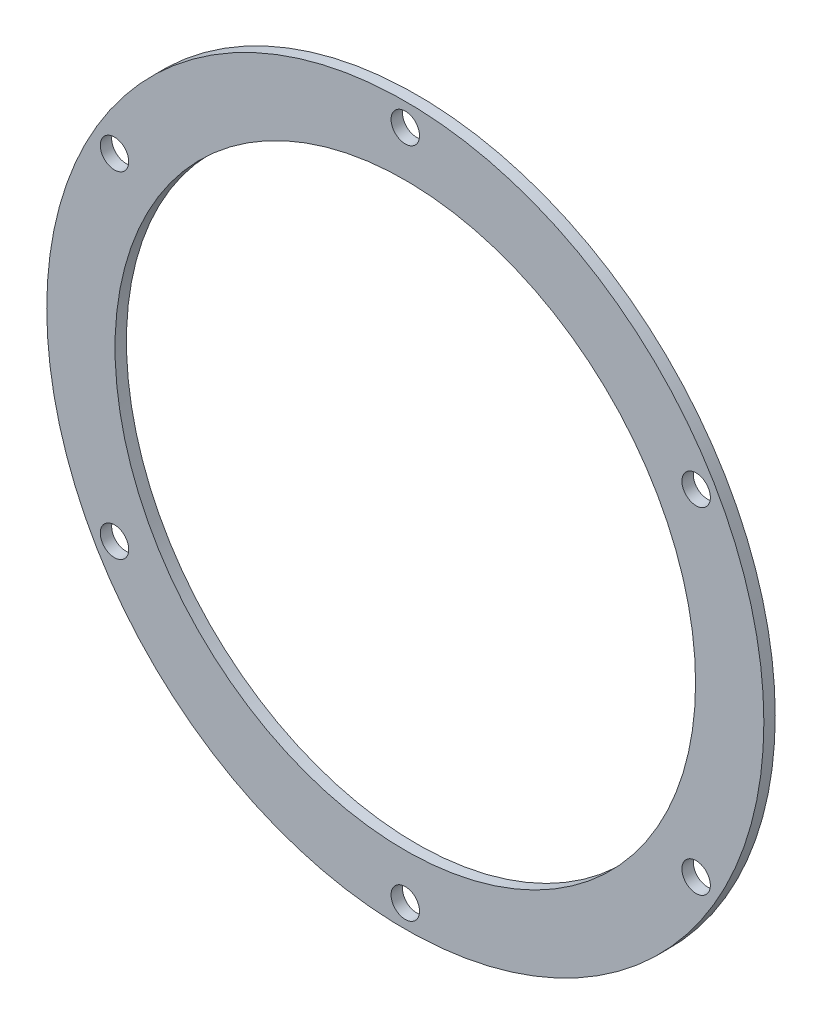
ISO-10303-21;
HEADER;
FILE_DESCRIPTION(('STEP AP214'),'2;1');
FILE_NAME('part.step','',(''),(''),'','','');
FILE_SCHEMA(('AUTOMOTIVE_DESIGN { 1 0 10303 214 1 1 1 1 }'));
ENDSEC;
DATA;
#1=APPLICATION_CONTEXT('core data for automotive mechanical design processes');
#2=APPLICATION_PROTOCOL_DEFINITION('international standard','automotive_design',2000,#1);
#3=PRODUCT_CONTEXT('',#1,'mechanical');
#4=PRODUCT('Part','Part','',(#3));
#5=PRODUCT_RELATED_PRODUCT_CATEGORY('part','',(#4));
#6=PRODUCT_DEFINITION_FORMATION('','',#4);
#7=PRODUCT_DEFINITION_CONTEXT('part definition',#1,'design');
#8=PRODUCT_DEFINITION('design','',#6,#7);
#9=PRODUCT_DEFINITION_SHAPE('','',#8);
#10=(LENGTH_UNIT() NAMED_UNIT(*) SI_UNIT(.MILLI.,.METRE.));
#11=(NAMED_UNIT(*) PLANE_ANGLE_UNIT() SI_UNIT($,.RADIAN.));
#12=(NAMED_UNIT(*) SI_UNIT($,.STERADIAN.) SOLID_ANGLE_UNIT());
#13=UNCERTAINTY_MEASURE_WITH_UNIT(LENGTH_MEASURE(1.E-05),#10,'distance_accuracy_value','');
#14=(GEOMETRIC_REPRESENTATION_CONTEXT(3) GLOBAL_UNCERTAINTY_ASSIGNED_CONTEXT((#13)) GLOBAL_UNIT_ASSIGNED_CONTEXT((#10,
#11,#12)) REPRESENTATION_CONTEXT('',''));
#15=CARTESIAN_POINT('',(0.,0.,0.));
#16=DIRECTION('',(0.,0.,1.));
#17=DIRECTION('',(1.,0.,0.));
#18=AXIS2_PLACEMENT_3D('',#15,#16,#17);
#19=CARTESIAN_POINT('',(0.,0.,0.));
#20=DIRECTION('',(0.,0.,1.));
#21=DIRECTION('',(1.,0.,0.));
#22=AXIS2_PLACEMENT_3D('',#19,#20,#21);
#23=PLANE('',#22);
#24=CARTESIAN_POINT('',(-25.5477494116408,14.7500000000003,0.));
#25=DIRECTION('',(0.,0.,1.));
#26=DIRECTION('',(1.,0.,0.));
#27=AXIS2_PLACEMENT_3D('',#24,#25,#26);
#28=CIRCLE('',#27,1.25);
#29=CARTESIAN_POINT('',(-24.2977494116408,14.7500000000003,0.));
#30=VERTEX_POINT('',#29);
#31=EDGE_CURVE('E137',#30,#30,#28,.T.);
#32=ORIENTED_EDGE('',*,*,#31,.T.);
#33=EDGE_LOOP('',(#32));
#34=FACE_BOUND('',#33,.T.);
#35=CARTESIAN_POINT('',(-25.5477494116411,-14.7499999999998,0.));
#36=DIRECTION('',(0.,0.,1.));
#37=DIRECTION('',(1.,0.,0.));
#38=AXIS2_PLACEMENT_3D('',#35,#36,#37);
#39=CIRCLE('',#38,1.25);
#40=CARTESIAN_POINT('',(-24.2977494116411,-14.7499999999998,0.));
#41=VERTEX_POINT('',#40);
#42=EDGE_CURVE('E125',#41,#41,#39,.T.);
#43=ORIENTED_EDGE('',*,*,#42,.T.);
#44=EDGE_LOOP('',(#43));
#45=FACE_BOUND('',#44,.T.);
#46=CARTESIAN_POINT('',(-2.05997398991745E-13,-29.5,0.));
#47=DIRECTION('',(0.,0.,1.));
#48=DIRECTION('',(1.,0.,0.));
#49=AXIS2_PLACEMENT_3D('',#46,#47,#48);
#50=CIRCLE('',#49,1.25);
#51=CARTESIAN_POINT('',(1.24999999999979,-29.5,0.));
#52=VERTEX_POINT('',#51);
#53=EDGE_CURVE('E37',#52,#52,#50,.T.);
#54=ORIENTED_EDGE('',*,*,#53,.T.);
#55=EDGE_LOOP('',(#54));
#56=FACE_BOUND('',#55,.T.);
#57=CARTESIAN_POINT('',(25.5477494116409,-14.7500000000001,0.));
#58=DIRECTION('',(0.,0.,1.));
#59=DIRECTION('',(1.,0.,0.));
#60=AXIS2_PLACEMENT_3D('',#57,#58,#59);
#61=CIRCLE('',#60,1.25);
#62=CARTESIAN_POINT('',(26.7977494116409,-14.7500000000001,0.));
#63=VERTEX_POINT('',#62);
#64=EDGE_CURVE('E115',#63,#63,#61,.T.);
#65=ORIENTED_EDGE('',*,*,#64,.T.);
#66=EDGE_LOOP('',(#65));
#67=FACE_BOUND('',#66,.T.);
#68=CARTESIAN_POINT('',(25.547749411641,14.75,0.));
#69=DIRECTION('',(0.,0.,1.));
#70=DIRECTION('',(1.,0.,0.));
#71=AXIS2_PLACEMENT_3D('',#68,#69,#70);
#72=CIRCLE('',#71,1.25);
#73=CARTESIAN_POINT('',(26.797749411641,14.75,0.));
#74=VERTEX_POINT('',#73);
#75=EDGE_CURVE('E39',#74,#74,#72,.T.);
#76=ORIENTED_EDGE('',*,*,#75,.T.);
#77=EDGE_LOOP('',(#76));
#78=FACE_BOUND('',#77,.T.);
#79=CARTESIAN_POINT('',(0.,29.5,0.));
#80=DIRECTION('',(0.,0.,1.));
#81=DIRECTION('',(1.,0.,0.));
#82=AXIS2_PLACEMENT_3D('',#79,#80,#81);
#83=CIRCLE('',#82,1.25);
#84=CARTESIAN_POINT('',(1.25,29.5,0.));
#85=VERTEX_POINT('',#84);
#86=EDGE_CURVE('E48',#85,#85,#83,.T.);
#87=ORIENTED_EDGE('',*,*,#86,.T.);
#88=EDGE_LOOP('',(#87));
#89=FACE_BOUND('',#88,.T.);
#90=CARTESIAN_POINT('',(0.,0.,0.));
#91=DIRECTION('',(0.,0.,1.));
#92=DIRECTION('',(1.,0.,0.));
#93=AXIS2_PLACEMENT_3D('',#90,#91,#92);
#94=CIRCLE('',#93,25.5);
#95=CARTESIAN_POINT('',(25.5,0.,0.));
#96=VERTEX_POINT('',#95);
#97=EDGE_CURVE('E19',#96,#96,#94,.T.);
#98=ORIENTED_EDGE('',*,*,#97,.T.);
#99=EDGE_LOOP('',(#98));
#100=FACE_BOUND('',#99,.T.);
#101=CARTESIAN_POINT('',(0.,0.,0.));
#102=DIRECTION('',(0.,0.,1.));
#103=DIRECTION('',(1.,0.,0.));
#104=AXIS2_PLACEMENT_3D('',#101,#102,#103);
#105=CIRCLE('',#104,31.5);
#106=CARTESIAN_POINT('',(31.5,0.,0.));
#107=VERTEX_POINT('',#106);
#108=EDGE_CURVE('E10',#107,#107,#105,.T.);
#109=ORIENTED_EDGE('',*,*,#108,.F.);
#110=EDGE_LOOP('',(#109));
#111=FACE_BOUND('',#110,.T.);
#112=ADVANCED_FACE('F15',(#34,#45,#56,#67,#78,#89,#100,#111),#23,.F.);
#113=CARTESIAN_POINT('',(0.,0.,1.));
#114=DIRECTION('',(0.,0.,1.));
#115=DIRECTION('',(1.,0.,0.));
#116=AXIS2_PLACEMENT_3D('',#113,#114,#115);
#117=PLANE('',#116);
#118=CARTESIAN_POINT('',(-25.5477494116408,14.7500000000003,1.));
#119=DIRECTION('',(0.,0.,1.));
#120=DIRECTION('',(1.,0.,0.));
#121=AXIS2_PLACEMENT_3D('',#118,#119,#120);
#122=CIRCLE('',#121,1.25);
#123=CARTESIAN_POINT('',(-24.2977494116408,14.7500000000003,1.));
#124=VERTEX_POINT('',#123);
#125=EDGE_CURVE('E143',#124,#124,#122,.T.);
#126=ORIENTED_EDGE('',*,*,#125,.F.);
#127=EDGE_LOOP('',(#126));
#128=FACE_BOUND('',#127,.T.);
#129=CARTESIAN_POINT('',(-2.05997398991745E-13,-29.5,1.));
#130=DIRECTION('',(0.,0.,1.));
#131=DIRECTION('',(1.,0.,0.));
#132=AXIS2_PLACEMENT_3D('',#129,#130,#131);
#133=CIRCLE('',#132,1.25);
#134=CARTESIAN_POINT('',(1.24999999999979,-29.5,1.));
#135=VERTEX_POINT('',#134);
#136=EDGE_CURVE('E128',#135,#135,#133,.T.);
#137=ORIENTED_EDGE('',*,*,#136,.F.);
#138=EDGE_LOOP('',(#137));
#139=FACE_BOUND('',#138,.T.);
#140=CARTESIAN_POINT('',(25.547749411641,14.75,1.));
#141=DIRECTION('',(0.,0.,1.));
#142=DIRECTION('',(1.,0.,0.));
#143=AXIS2_PLACEMENT_3D('',#140,#141,#142);
#144=CIRCLE('',#143,1.25);
#145=CARTESIAN_POINT('',(26.797749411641,14.75,1.));
#146=VERTEX_POINT('',#145);
#147=EDGE_CURVE('E44',#146,#146,#144,.T.);
#148=ORIENTED_EDGE('',*,*,#147,.F.);
#149=EDGE_LOOP('',(#148));
#150=FACE_BOUND('',#149,.T.);
#151=CARTESIAN_POINT('',(0.,0.,1.));
#152=DIRECTION('',(0.,0.,1.));
#153=DIRECTION('',(1.,0.,0.));
#154=AXIS2_PLACEMENT_3D('',#151,#152,#153);
#155=CIRCLE('',#154,25.5);
#156=CARTESIAN_POINT('',(25.5,0.,1.));
#157=VERTEX_POINT('',#156);
#158=EDGE_CURVE('E51',#157,#157,#155,.T.);
#159=ORIENTED_EDGE('',*,*,#158,.F.);
#160=EDGE_LOOP('',(#159));
#161=FACE_BOUND('',#160,.T.);
#162=CARTESIAN_POINT('',(0.,29.5,1.));
#163=DIRECTION('',(0.,0.,1.));
#164=DIRECTION('',(1.,0.,0.));
#165=AXIS2_PLACEMENT_3D('',#162,#163,#164);
#166=CIRCLE('',#165,1.25);
#167=CARTESIAN_POINT('',(1.25,29.5,1.));
#168=VERTEX_POINT('',#167);
#169=EDGE_CURVE('E43',#168,#168,#166,.T.);
#170=ORIENTED_EDGE('',*,*,#169,.F.);
#171=EDGE_LOOP('',(#170));
#172=FACE_BOUND('',#171,.T.);
#173=CARTESIAN_POINT('',(25.5477494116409,-14.7500000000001,1.));
#174=DIRECTION('',(0.,0.,1.));
#175=DIRECTION('',(1.,0.,0.));
#176=AXIS2_PLACEMENT_3D('',#173,#174,#175);
#177=CIRCLE('',#176,1.25);
#178=CARTESIAN_POINT('',(26.7977494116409,-14.7500000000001,1.));
#179=VERTEX_POINT('',#178);
#180=EDGE_CURVE('E121',#179,#179,#177,.T.);
#181=ORIENTED_EDGE('',*,*,#180,.F.);
#182=EDGE_LOOP('',(#181));
#183=FACE_BOUND('',#182,.T.);
#184=CARTESIAN_POINT('',(-25.5477494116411,-14.7499999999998,1.));
#185=DIRECTION('',(0.,0.,1.));
#186=DIRECTION('',(1.,0.,0.));
#187=AXIS2_PLACEMENT_3D('',#184,#185,#186);
#188=CIRCLE('',#187,1.25);
#189=CARTESIAN_POINT('',(-24.2977494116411,-14.7499999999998,1.));
#190=VERTEX_POINT('',#189);
#191=EDGE_CURVE('E124',#190,#190,#188,.T.);
#192=ORIENTED_EDGE('',*,*,#191,.F.);
#193=EDGE_LOOP('',(#192));
#194=FACE_BOUND('',#193,.T.);
#195=CARTESIAN_POINT('',(0.,0.,1.));
#196=DIRECTION('',(0.,0.,1.));
#197=DIRECTION('',(1.,0.,0.));
#198=AXIS2_PLACEMENT_3D('',#195,#196,#197);
#199=CIRCLE('',#198,31.5);
#200=CARTESIAN_POINT('',(31.5,0.,1.));
#201=VERTEX_POINT('',#200);
#202=EDGE_CURVE('E24',#201,#201,#199,.T.);
#203=ORIENTED_EDGE('',*,*,#202,.T.);
#204=EDGE_LOOP('',(#203));
#205=FACE_BOUND('',#204,.T.);
#206=ADVANCED_FACE('F77',(#128,#139,#150,#161,#172,#183,#194,#205),#117,.T.);
#207=CARTESIAN_POINT('',(0.,0.,1.));
#208=DIRECTION('',(0.,0.,-1.));
#209=DIRECTION('',(-1.,0.,0.));
#210=AXIS2_PLACEMENT_3D('',#207,#208,#209);
#211=CYLINDRICAL_SURFACE('',#210,31.5);
#212=ORIENTED_EDGE('',*,*,#108,.T.);
#213=EDGE_LOOP('',(#212));
#214=FACE_BOUND('',#213,.T.);
#215=ORIENTED_EDGE('',*,*,#202,.F.);
#216=EDGE_LOOP('',(#215));
#217=FACE_BOUND('',#216,.T.);
#218=ADVANCED_FACE('F17',(#214,#217),#211,.T.);
#219=CARTESIAN_POINT('',(0.,0.,1.));
#220=DIRECTION('',(0.,0.,-1.));
#221=DIRECTION('',(-1.,0.,0.));
#222=AXIS2_PLACEMENT_3D('',#219,#220,#221);
#223=CYLINDRICAL_SURFACE('',#222,25.5);
#224=ORIENTED_EDGE('',*,*,#97,.F.);
#225=EDGE_LOOP('',(#224));
#226=FACE_BOUND('',#225,.T.);
#227=ORIENTED_EDGE('',*,*,#158,.T.);
#228=EDGE_LOOP('',(#227));
#229=FACE_BOUND('',#228,.T.);
#230=ADVANCED_FACE('F66',(#226,#229),#223,.F.);
#231=CARTESIAN_POINT('',(0.,29.5,1.));
#232=DIRECTION('',(0.,0.,-1.));
#233=DIRECTION('',(-1.,0.,0.));
#234=AXIS2_PLACEMENT_3D('',#231,#232,#233);
#235=CYLINDRICAL_SURFACE('',#234,1.25);
#236=ORIENTED_EDGE('',*,*,#86,.F.);
#237=EDGE_LOOP('',(#236));
#238=FACE_BOUND('',#237,.T.);
#239=ORIENTED_EDGE('',*,*,#169,.T.);
#240=EDGE_LOOP('',(#239));
#241=FACE_BOUND('',#240,.T.);
#242=ADVANCED_FACE('F68',(#238,#241),#235,.F.);
#243=CARTESIAN_POINT('',(25.547749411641,14.75,1.));
#244=DIRECTION('',(0.,0.,-1.));
#245=DIRECTION('',(-1.,0.,0.));
#246=AXIS2_PLACEMENT_3D('',#243,#244,#245);
#247=CYLINDRICAL_SURFACE('',#246,1.25);
#248=ORIENTED_EDGE('',*,*,#75,.F.);
#249=EDGE_LOOP('',(#248));
#250=FACE_BOUND('',#249,.T.);
#251=ORIENTED_EDGE('',*,*,#147,.T.);
#252=EDGE_LOOP('',(#251));
#253=FACE_BOUND('',#252,.T.);
#254=ADVANCED_FACE('F74',(#250,#253),#247,.F.);
#255=CARTESIAN_POINT('',(25.5477494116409,-14.7500000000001,1.));
#256=DIRECTION('',(0.,0.,-1.));
#257=DIRECTION('',(-1.,0.,0.));
#258=AXIS2_PLACEMENT_3D('',#255,#256,#257);
#259=CYLINDRICAL_SURFACE('',#258,1.25);
#260=ORIENTED_EDGE('',*,*,#64,.F.);
#261=EDGE_LOOP('',(#260));
#262=FACE_BOUND('',#261,.T.);
#263=ORIENTED_EDGE('',*,*,#180,.T.);
#264=EDGE_LOOP('',(#263));
#265=FACE_BOUND('',#264,.T.);
#266=ADVANCED_FACE('F100',(#262,#265),#259,.F.);
#267=CARTESIAN_POINT('',(-2.05997398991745E-13,-29.5,1.));
#268=DIRECTION('',(0.,0.,-1.));
#269=DIRECTION('',(-1.,0.,0.));
#270=AXIS2_PLACEMENT_3D('',#267,#268,#269);
#271=CYLINDRICAL_SURFACE('',#270,1.25);
#272=ORIENTED_EDGE('',*,*,#53,.F.);
#273=EDGE_LOOP('',(#272));
#274=FACE_BOUND('',#273,.T.);
#275=ORIENTED_EDGE('',*,*,#136,.T.);
#276=EDGE_LOOP('',(#275));
#277=FACE_BOUND('',#276,.T.);
#278=ADVANCED_FACE('F96',(#274,#277),#271,.F.);
#279=CARTESIAN_POINT('',(-25.5477494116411,-14.7499999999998,1.));
#280=DIRECTION('',(0.,0.,-1.));
#281=DIRECTION('',(-1.,0.,0.));
#282=AXIS2_PLACEMENT_3D('',#279,#280,#281);
#283=CYLINDRICAL_SURFACE('',#282,1.25);
#284=ORIENTED_EDGE('',*,*,#42,.F.);
#285=EDGE_LOOP('',(#284));
#286=FACE_BOUND('',#285,.T.);
#287=ORIENTED_EDGE('',*,*,#191,.T.);
#288=EDGE_LOOP('',(#287));
#289=FACE_BOUND('',#288,.T.);
#290=ADVANCED_FACE('F92',(#286,#289),#283,.F.);
#291=CARTESIAN_POINT('',(-25.5477494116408,14.7500000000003,1.));
#292=DIRECTION('',(0.,0.,-1.));
#293=DIRECTION('',(-1.,0.,0.));
#294=AXIS2_PLACEMENT_3D('',#291,#292,#293);
#295=CYLINDRICAL_SURFACE('',#294,1.25);
#296=ORIENTED_EDGE('',*,*,#31,.F.);
#297=EDGE_LOOP('',(#296));
#298=FACE_BOUND('',#297,.T.);
#299=ORIENTED_EDGE('',*,*,#125,.T.);
#300=EDGE_LOOP('',(#299));
#301=FACE_BOUND('',#300,.T.);
#302=ADVANCED_FACE('F89',(#298,#301),#295,.F.);
#303=CLOSED_SHELL('',(#112,#206,#218,#230,#242,#254,#266,#278,#290,#302));
#304=MANIFOLD_SOLID_BREP('B1',#303);
#305=ADVANCED_BREP_SHAPE_REPRESENTATION('',(#18,#304),#14);
#306=SHAPE_DEFINITION_REPRESENTATION(#9,#305);
ENDSEC;
END-ISO-10303-21;
